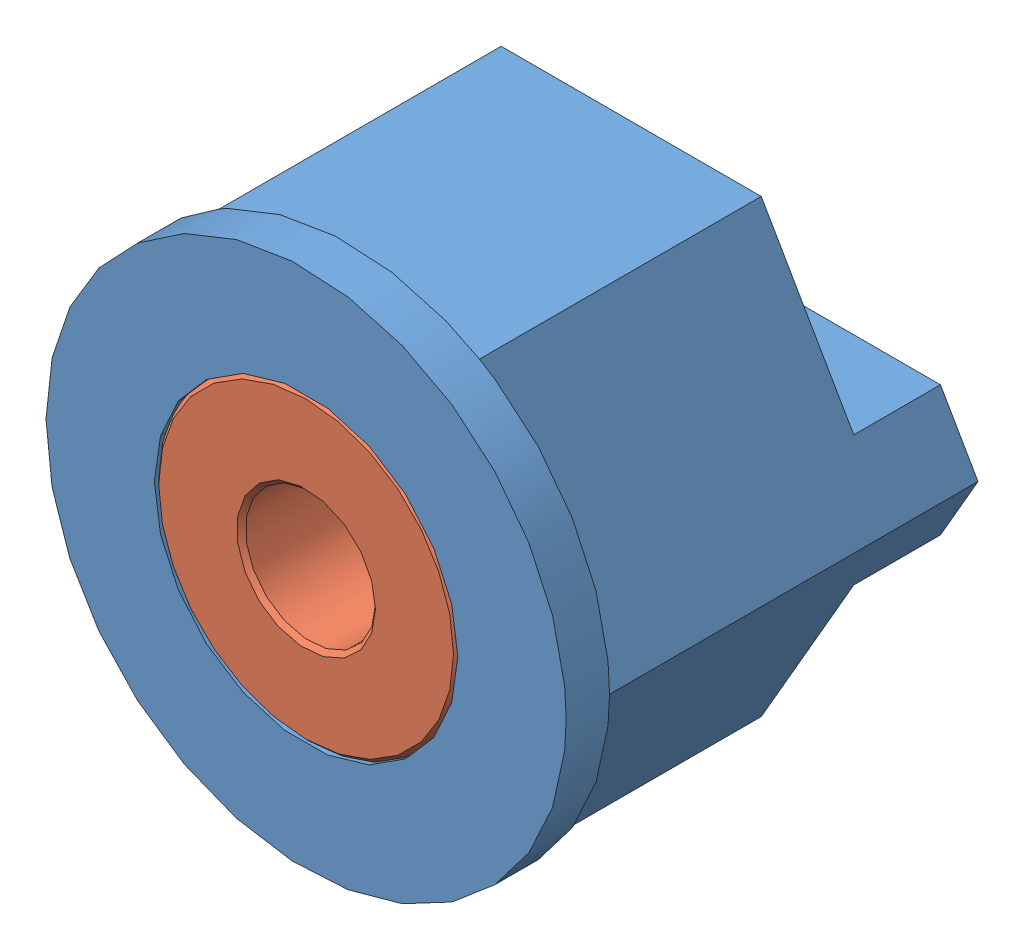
SolidWorks assembly Palier balayeuse équipé.SLDASM, configuration Défaut (file format 3100). Lengths in mm.
Overall size (12 12 9.5).
2 component instances, 2 part files, 2 mates.
Components (placement in the parent):
- Palier balayeuse-1: Palier balayeuse.SLDPRT [Défaut] at origin size (12 12 9.5)
- Coussinet balayeuse-1: Coussinet balayeuse.SLDPRT [Brosse] at (0 0 -3) size (7 7 7)
Mates (geometry in assembly coordinates):
- Coaxial1: concentric anti-aligned: cylinder of Palier balayeuse-1; cylinder of Coussinet balayeuse-1
- Coïncidente1: coincident aligned: plane of Palier balayeuse-1 through (0 0 0.5) normal (0 0 1); plane of Coussinet balayeuse-1
